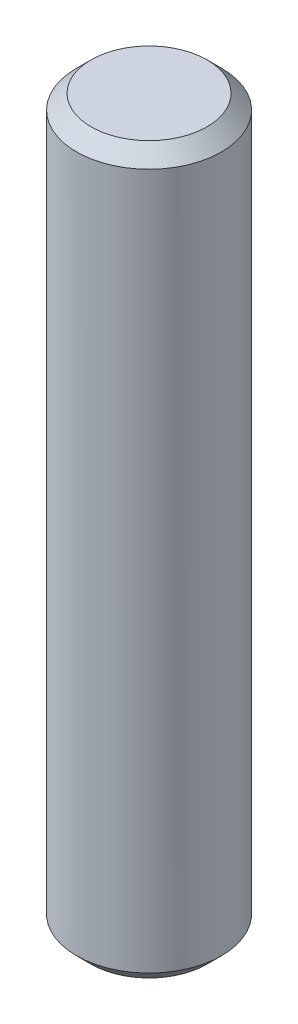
ISO-10303-21;
HEADER;
FILE_DESCRIPTION(('STEP AP214'),'2;1');
FILE_NAME('part.step','',(''),(''),'','','');
FILE_SCHEMA(('AUTOMOTIVE_DESIGN { 1 0 10303 214 1 1 1 1 }'));
ENDSEC;
DATA;
#1=APPLICATION_CONTEXT('core data for automotive mechanical design processes');
#2=APPLICATION_PROTOCOL_DEFINITION('international standard','automotive_design',2000,#1);
#3=PRODUCT_CONTEXT('',#1,'mechanical');
#4=PRODUCT('Part','Part','',(#3));
#5=PRODUCT_RELATED_PRODUCT_CATEGORY('part','',(#4));
#6=PRODUCT_DEFINITION_FORMATION('','',#4);
#7=PRODUCT_DEFINITION_CONTEXT('part definition',#1,'design');
#8=PRODUCT_DEFINITION('design','',#6,#7);
#9=PRODUCT_DEFINITION_SHAPE('','',#8);
#10=(LENGTH_UNIT() NAMED_UNIT(*) SI_UNIT(.MILLI.,.METRE.));
#11=(NAMED_UNIT(*) PLANE_ANGLE_UNIT() SI_UNIT($,.RADIAN.));
#12=(NAMED_UNIT(*) SI_UNIT($,.STERADIAN.) SOLID_ANGLE_UNIT());
#13=UNCERTAINTY_MEASURE_WITH_UNIT(LENGTH_MEASURE(1.E-05),#10,'distance_accuracy_value','');
#14=(GEOMETRIC_REPRESENTATION_CONTEXT(3) GLOBAL_UNCERTAINTY_ASSIGNED_CONTEXT((#13)) GLOBAL_UNIT_ASSIGNED_CONTEXT((#10,
#11,#12)) REPRESENTATION_CONTEXT('',''));
#15=CARTESIAN_POINT('',(0.,0.,0.));
#16=DIRECTION('',(0.,0.,1.));
#17=DIRECTION('',(1.,0.,0.));
#18=AXIS2_PLACEMENT_3D('',#15,#16,#17);
#19=CARTESIAN_POINT('',(0.,5.,0.));
#20=DIRECTION('',(0.,1.,0.));
#21=DIRECTION('',(0.,0.,1.));
#22=AXIS2_PLACEMENT_3D('',#19,#20,#21);
#23=PLANE('',#22);
#24=CARTESIAN_POINT('',(0.,5.0000000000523,0.));
#25=DIRECTION('',(0.,-1.,0.));
#26=DIRECTION('',(0.,0.,-1.));
#27=AXIS2_PLACEMENT_3D('',#24,#25,#26);
#28=CIRCLE('',#27,0.400000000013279);
#29=CARTESIAN_POINT('',(0.,5.0000000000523,-0.400000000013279));
#30=VERTEX_POINT('',#29);
#31=EDGE_CURVE('E18',#30,#30,#28,.T.);
#32=ORIENTED_EDGE('',*,*,#31,.F.);
#33=EDGE_LOOP('',(#32));
#34=FACE_BOUND('',#33,.T.);
#35=ADVANCED_FACE('F15',(#34),#23,.T.);
#36=CARTESIAN_POINT('',(0.,0.,0.));
#37=DIRECTION('',(0.,1.,0.));
#38=DIRECTION('',(0.,0.,1.));
#39=AXIS2_PLACEMENT_3D('',#36,#37,#38);
#40=PLANE('',#39);
#41=CARTESIAN_POINT('',(0.,0.,0.));
#42=DIRECTION('',(0.,1.,0.));
#43=DIRECTION('',(0.,0.,1.));
#44=AXIS2_PLACEMENT_3D('',#41,#42,#43);
#45=CIRCLE('',#44,0.400000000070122);
#46=CARTESIAN_POINT('',(0.,0.,0.400000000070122));
#47=VERTEX_POINT('',#46);
#48=EDGE_CURVE('E27',#47,#47,#45,.T.);
#49=ORIENTED_EDGE('',*,*,#48,.F.);
#50=EDGE_LOOP('',(#49));
#51=FACE_BOUND('',#50,.T.);
#52=ADVANCED_FACE('F38',(#51),#40,.F.);
#53=CARTESIAN_POINT('',(0.,4.90000000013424,0.));
#54=DIRECTION('',(0.,-1.,0.));
#55=DIRECTION('',(0.,0.,-1.));
#56=AXIS2_PLACEMENT_3D('',#53,#54,#55);
#57=CONICAL_SURFACE('',#56,0.499999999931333,0.785398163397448);
#58=CARTESIAN_POINT('',(0.,4.9,0.));
#59=DIRECTION('',(0.,-1.,0.));
#60=DIRECTION('',(0.,0.,-1.));
#61=AXIS2_PLACEMENT_3D('',#58,#59,#60);
#62=CIRCLE('',#61,0.5);
#63=CARTESIAN_POINT('',(0.,4.9,-0.5));
#64=VERTEX_POINT('',#63);
#65=EDGE_CURVE('E22',#64,#64,#62,.T.);
#66=ORIENTED_EDGE('',*,*,#65,.F.);
#67=EDGE_LOOP('',(#66));
#68=FACE_BOUND('',#67,.T.);
#69=ORIENTED_EDGE('',*,*,#31,.T.);
#70=EDGE_LOOP('',(#69));
#71=FACE_BOUND('',#70,.T.);
#72=ADVANCED_FACE('F35',(#68,#71),#57,.T.);
#73=CARTESIAN_POINT('',(0.,0.100000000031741,0.));
#74=DIRECTION('',(0.,1.,0.));
#75=DIRECTION('',(0.,0.,1.));
#76=AXIS2_PLACEMENT_3D('',#73,#74,#75);
#77=CONICAL_SURFACE('',#76,0.50000000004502,0.785398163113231);
#78=CARTESIAN_POINT('',(0.,0.0999999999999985,0.));
#79=DIRECTION('',(0.,-1.,0.));
#80=DIRECTION('',(0.,0.,-1.));
#81=AXIS2_PLACEMENT_3D('',#78,#79,#80);
#82=CIRCLE('',#81,0.5);
#83=CARTESIAN_POINT('',(0.,0.0999999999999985,-0.5));
#84=VERTEX_POINT('',#83);
#85=EDGE_CURVE('E10',#84,#84,#82,.F.);
#86=ORIENTED_EDGE('',*,*,#85,.F.);
#87=EDGE_LOOP('',(#86));
#88=FACE_BOUND('',#87,.T.);
#89=ORIENTED_EDGE('',*,*,#48,.T.);
#90=EDGE_LOOP('',(#89));
#91=FACE_BOUND('',#90,.T.);
#92=ADVANCED_FACE('F46',(#88,#91),#77,.T.);
#93=CARTESIAN_POINT('',(0.,5.,0.));
#94=DIRECTION('',(0.,-1.,0.));
#95=DIRECTION('',(0.,0.,-1.));
#96=AXIS2_PLACEMENT_3D('',#93,#94,#95);
#97=CYLINDRICAL_SURFACE('',#96,0.5);
#98=ORIENTED_EDGE('',*,*,#85,.T.);
#99=EDGE_LOOP('',(#98));
#100=FACE_BOUND('',#99,.T.);
#101=ORIENTED_EDGE('',*,*,#65,.T.);
#102=EDGE_LOOP('',(#101));
#103=FACE_BOUND('',#102,.T.);
#104=ADVANCED_FACE('F44',(#100,#103),#97,.T.);
#105=CLOSED_SHELL('',(#35,#52,#72,#92,#104));
#106=MANIFOLD_SOLID_BREP('B1',#105);
#107=ADVANCED_BREP_SHAPE_REPRESENTATION('',(#18,#106),#14);
#108=SHAPE_DEFINITION_REPRESENTATION(#9,#107);
ENDSEC;
END-ISO-10303-21;
